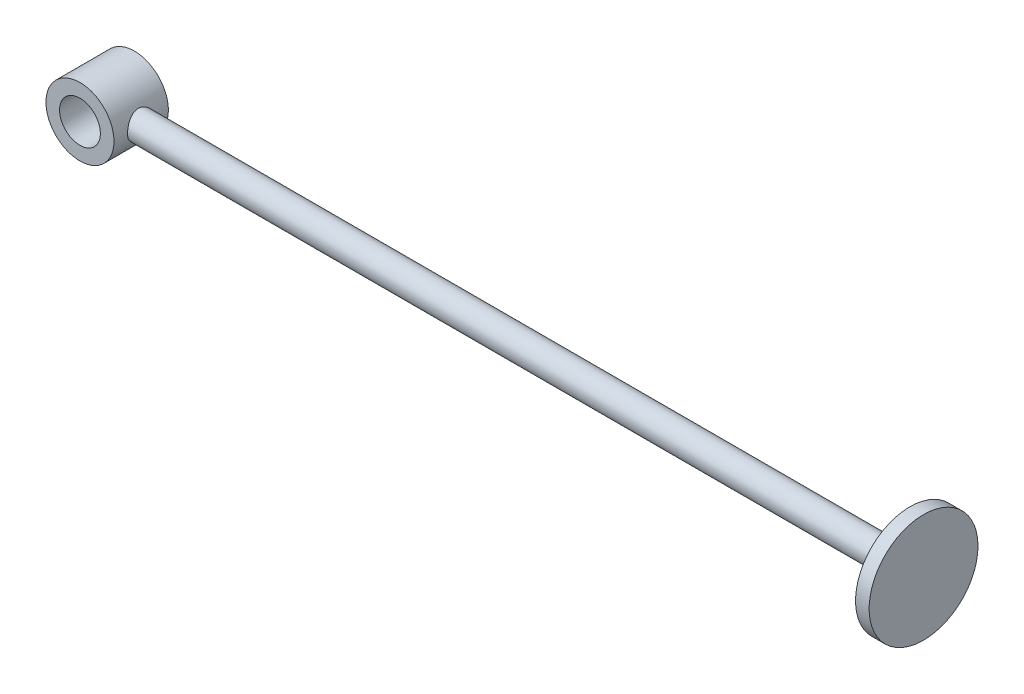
ISO-10303-21;
HEADER;
FILE_DESCRIPTION(('STEP AP214'),'2;1');
FILE_NAME('part.step','',(''),(''),'','','');
FILE_SCHEMA(('AUTOMOTIVE_DESIGN { 1 0 10303 214 1 1 1 1 }'));
ENDSEC;
DATA;
#1=APPLICATION_CONTEXT('core data for automotive mechanical design processes');
#2=APPLICATION_PROTOCOL_DEFINITION('international standard','automotive_design',2000,#1);
#3=PRODUCT_CONTEXT('',#1,'mechanical');
#4=PRODUCT('Part','Part','',(#3));
#5=PRODUCT_RELATED_PRODUCT_CATEGORY('part','',(#4));
#6=PRODUCT_DEFINITION_FORMATION('','',#4);
#7=PRODUCT_DEFINITION_CONTEXT('part definition',#1,'design');
#8=PRODUCT_DEFINITION('design','',#6,#7);
#9=PRODUCT_DEFINITION_SHAPE('','',#8);
#10=(LENGTH_UNIT() NAMED_UNIT(*) SI_UNIT(.MILLI.,.METRE.));
#11=(NAMED_UNIT(*) PLANE_ANGLE_UNIT() SI_UNIT($,.RADIAN.));
#12=(NAMED_UNIT(*) SI_UNIT($,.STERADIAN.) SOLID_ANGLE_UNIT());
#13=UNCERTAINTY_MEASURE_WITH_UNIT(LENGTH_MEASURE(1.E-05),#10,'distance_accuracy_value','');
#14=(GEOMETRIC_REPRESENTATION_CONTEXT(3) GLOBAL_UNCERTAINTY_ASSIGNED_CONTEXT((#13)) GLOBAL_UNIT_ASSIGNED_CONTEXT((#10,
#11,#12)) REPRESENTATION_CONTEXT('',''));
#15=CARTESIAN_POINT('',(0.,0.,0.));
#16=DIRECTION('',(0.,0.,1.));
#17=DIRECTION('',(1.,0.,0.));
#18=AXIS2_PLACEMENT_3D('',#15,#16,#17);
#19=CARTESIAN_POINT('',(300.000000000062,-1.32782673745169E-10,8.5265128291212E-11));
#20=DIRECTION('',(1.00000000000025,0.,0.));
#21=DIRECTION('',(0.,0.,-0.99999999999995));
#22=AXIS2_PLACEMENT_3D('',#19,#20,#21);
#23=CYLINDRICAL_SURFACE('',#22,5.);
#24=CARTESIAN_POINT('',(295.000000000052,3.06421554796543E-11,1.02140518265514E-11));
#25=DIRECTION('',(1.00000000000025,0.,0.));
#26=DIRECTION('',(0.,0.,-0.99999999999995));
#27=AXIS2_PLACEMENT_3D('',#24,#25,#26);
#28=CIRCLE('',#27,5.);
#29=CARTESIAN_POINT('',(295.000000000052,3.06411840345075E-11,-4.99999999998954));
#30=VERTEX_POINT('',#29);
#31=EDGE_CURVE('E25',#30,#30,#28,.T.);
#32=ORIENTED_EDGE('',*,*,#31,.F.);
#33=EDGE_LOOP('',(#32));
#34=FACE_BOUND('',#33,.T.);
#35=CARTESIAN_POINT('',(12.4999999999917,-6.08402217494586E-11,-5.00000000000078));
#36=CARTESIAN_POINT('',(12.4999993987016,0.134428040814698,-4.99999922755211));
#37=CARTESIAN_POINT('',(12.4978254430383,0.268907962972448,-4.9945712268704));
#38=CARTESIAN_POINT('',(12.4891841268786,0.536916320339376,-4.97290825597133));
#39=CARTESIAN_POINT('',(12.4827138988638,0.670444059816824,-4.95666606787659));
#40=CARTESIAN_POINT('',(12.4656328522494,0.93579206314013,-4.91349125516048));
#41=CARTESIAN_POINT('',(12.4550131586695,1.06760803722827,-4.88653571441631));
#42=CARTESIAN_POINT('',(12.4299104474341,1.32834211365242,-4.82219349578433));
#43=CARTESIAN_POINT('',(12.4154258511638,1.45725900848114,-4.78480255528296));
#44=CARTESIAN_POINT('',(12.3830283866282,1.71081101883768,-4.70009768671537));
#45=CARTESIAN_POINT('',(12.3651284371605,1.83546024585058,-4.65282108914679));
#46=CARTESIAN_POINT('',(12.3263173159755,2.08021423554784,-4.54867299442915));
#47=CARTESIAN_POINT('',(12.3054050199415,2.20031728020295,-4.49179791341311));
#48=CARTESIAN_POINT('',(12.2389309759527,2.55253650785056,-4.30750693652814));
#49=CARTESIAN_POINT('',(12.1895849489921,2.77691477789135,-4.16630678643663));
#50=CARTESIAN_POINT('',(12.0832695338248,3.20878788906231,-3.84440507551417));
#51=CARTESIAN_POINT('',(12.0260638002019,3.41514420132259,-3.66226779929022));
#52=CARTESIAN_POINT('',(11.9115080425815,3.79544899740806,-3.26646553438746));
#53=CARTESIAN_POINT('',(11.8541579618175,3.96938162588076,-3.05278521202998));
#54=CARTESIAN_POINT('',(11.7714356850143,4.20603567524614,-2.70739394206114));
#55=CARTESIAN_POINT('',(11.7438622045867,4.28222203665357,-2.58522008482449));
#56=CARTESIAN_POINT('',(11.6912035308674,4.42396507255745,-2.3343638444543));
#57=CARTESIAN_POINT('',(11.6661173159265,4.48952611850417,-2.20568416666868));
#58=CARTESIAN_POINT('',(11.6192528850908,4.60945924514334,-1.9426245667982));
#59=CARTESIAN_POINT('',(11.5974748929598,4.66383056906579,-1.80824425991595));
#60=CARTESIAN_POINT('',(11.5579971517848,4.76082403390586,-1.53479113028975));
#61=CARTESIAN_POINT('',(11.5402953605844,4.80345206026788,-1.39572069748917));
#62=CARTESIAN_POINT('',(11.5103008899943,4.87487504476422,-1.12023380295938));
#63=CARTESIAN_POINT('',(11.4978009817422,4.90420529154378,-0.983978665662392));
#64=CARTESIAN_POINT('',(11.4775526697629,4.95140857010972,-0.709206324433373));
#65=CARTESIAN_POINT('',(11.4698021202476,4.96928677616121,-0.570690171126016));
#66=CARTESIAN_POINT('',(11.459329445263,4.99338985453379,-0.292486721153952));
#67=CARTESIAN_POINT('',(11.4566062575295,4.99961718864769,-0.152799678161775));
#68=CARTESIAN_POINT('',(11.4562871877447,5.00034850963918,0.126607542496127));
#69=CARTESIAN_POINT('',(11.4586910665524,4.99485304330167,0.266327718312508));
#70=CARTESIAN_POINT('',(11.4681900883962,4.97300139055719,0.534904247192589));
#71=CARTESIAN_POINT('',(11.4749456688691,4.95743098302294,0.663837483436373));
#72=CARTESIAN_POINT('',(11.4925992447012,4.9163666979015,0.919866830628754));
#73=CARTESIAN_POINT('',(11.5034986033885,4.89086955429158,1.04696232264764));
#74=CARTESIAN_POINT('',(11.5291029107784,4.83020381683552,1.29840172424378));
#75=CARTESIAN_POINT('',(11.5438069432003,4.79503755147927,1.42274628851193));
#76=CARTESIAN_POINT('',(11.5765839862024,4.71535272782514,1.66796184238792));
#77=CARTESIAN_POINT('',(11.5946582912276,4.67083057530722,1.78883147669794));
#78=CARTESIAN_POINT('',(11.6539749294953,4.52178156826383,2.14989977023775));
#79=CARTESIAN_POINT('',(11.6997808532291,4.40296429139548,2.38363297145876));
#80=CARTESIAN_POINT('',(11.7984565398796,4.1312515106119,2.82857968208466));
#81=CARTESIAN_POINT('',(11.8513289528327,3.9783432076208,3.03978468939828));
#82=CARTESIAN_POINT('',(11.9631659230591,3.62889137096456,3.45100744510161));
#83=CARTESIAN_POINT('',(12.0222854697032,3.42988845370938,3.64889829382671));
#84=CARTESIAN_POINT('',(12.1365017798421,3.00074126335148,4.00923472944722));
#85=CARTESIAN_POINT('',(12.1915977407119,2.77059080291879,4.17167325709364));
#86=CARTESIAN_POINT('',(12.2673153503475,2.4039718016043,4.38652495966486));
#87=CARTESIAN_POINT('',(12.2916102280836,2.27679500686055,4.45387262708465));
#88=CARTESIAN_POINT('',(12.3369572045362,2.01664956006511,4.57753555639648));
#89=CARTESIAN_POINT('',(12.3580106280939,1.88368330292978,4.63385532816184));
#90=CARTESIAN_POINT('',(12.3962575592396,1.6129159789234,4.73491158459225));
#91=CARTESIAN_POINT('',(12.4134518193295,1.47511586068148,4.77965032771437));
#92=CARTESIAN_POINT('',(12.4434728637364,1.19570710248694,4.85708691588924));
#93=CARTESIAN_POINT('',(12.4562999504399,1.05409872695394,4.88978559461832));
#94=CARTESIAN_POINT('',(12.4765727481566,0.776729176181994,4.94119316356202));
#95=CARTESIAN_POINT('',(12.4842928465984,0.641120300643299,4.96061765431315));
#96=CARTESIAN_POINT('',(12.4953107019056,0.368536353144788,4.98828145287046));
#97=CARTESIAN_POINT('',(12.4986069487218,0.231560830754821,4.99651694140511));
#98=CARTESIAN_POINT('',(12.5006785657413,-0.0425534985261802,5.00169671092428));
#99=CARTESIAN_POINT('',(12.4994566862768,-0.179692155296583,4.99864786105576));
#100=CARTESIAN_POINT('',(12.4925311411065,-0.45319364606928,4.98130482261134));
#101=CARTESIAN_POINT('',(12.4868258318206,-0.58955617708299,4.96700651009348));
#102=CARTESIAN_POINT('',(12.4714486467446,-0.854248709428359,4.92821788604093));
#103=CARTESIAN_POINT('',(12.461968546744,-0.982662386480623,4.90421959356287));
#104=CARTESIAN_POINT('',(12.4393027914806,-1.23695148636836,4.84633496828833));
#105=CARTESIAN_POINT('',(12.4261158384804,-1.3628260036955,4.81244517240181));
#106=CARTESIAN_POINT('',(12.3963630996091,-1.61115102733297,4.73509171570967));
#107=CARTESIAN_POINT('',(12.3797982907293,-1.73360251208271,4.69163082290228));
#108=CARTESIAN_POINT('',(12.3436873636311,-1.97439656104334,4.59549698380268));
#109=CARTESIAN_POINT('',(12.3241401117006,-2.0927375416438,4.54282053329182));
#110=CARTESIAN_POINT('',(12.2604306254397,-2.44755555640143,4.36809274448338));
#111=CARTESIAN_POINT('',(12.2121249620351,-2.67640599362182,4.23165397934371));
#112=CARTESIAN_POINT('',(12.1093295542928,-3.10864805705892,3.92513152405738));
#113=CARTESIAN_POINT('',(12.0548373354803,-3.31202942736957,3.7550343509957));
#114=CARTESIAN_POINT('',(11.9411305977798,-3.70179180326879,3.37284153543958));
#115=CARTESIAN_POINT('',(11.8818418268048,-3.88616393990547,3.1587145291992));
#116=CARTESIAN_POINT('',(11.7685360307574,-4.21689889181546,2.70135140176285));
#117=CARTESIAN_POINT('',(11.7145198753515,-4.36325544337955,2.45811049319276));
#118=CARTESIAN_POINT('',(11.6421255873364,-4.55142555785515,2.07488132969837));
#119=CARTESIAN_POINT('',(11.6193337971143,-4.60914530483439,1.94332027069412));
#120=CARTESIAN_POINT('',(11.5775147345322,-4.71320516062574,1.67521283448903));
#121=CARTESIAN_POINT('',(11.5584858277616,-4.75955021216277,1.53866865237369));
#122=CARTESIAN_POINT('',(11.5248785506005,-4.84036067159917,1.26163687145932));
#123=CARTESIAN_POINT('',(11.5102984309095,-4.87483074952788,1.12115084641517));
#124=CARTESIAN_POINT('',(11.4861263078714,-4.93151664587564,0.837305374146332));
#125=CARTESIAN_POINT('',(11.4765338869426,-4.9537334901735,0.693946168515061));
#126=CARTESIAN_POINT('',(11.4632105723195,-4.98448195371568,0.416001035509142));
#127=CARTESIAN_POINT('',(11.4591065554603,-4.99388565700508,0.281528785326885));
#128=CARTESIAN_POINT('',(11.4556539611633,-5.0018009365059,0.0121539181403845));
#129=CARTESIAN_POINT('',(11.4563069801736,-5.0003088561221,-0.122748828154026));
#130=CARTESIAN_POINT('',(11.4623486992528,-4.98644346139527,-0.391817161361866));
#131=CARTESIAN_POINT('',(11.4677350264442,-4.97407559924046,-0.525983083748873));
#132=CARTESIAN_POINT('',(11.4830569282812,-4.93860056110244,-0.792672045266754));
#133=CARTESIAN_POINT('',(11.4929942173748,-4.91548933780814,-0.925194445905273));
#134=CARTESIAN_POINT('',(11.5166044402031,-4.85990688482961,-1.1823296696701));
#135=CARTESIAN_POINT('',(11.530111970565,-4.82784722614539,-1.30704679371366));
#136=CARTESIAN_POINT('',(11.5606089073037,-4.75435551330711,-1.55326624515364));
#137=CARTESIAN_POINT('',(11.5775995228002,-4.71292020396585,-1.67476743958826));
#138=CARTESIAN_POINT('',(11.6330901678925,-4.575050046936,-2.03331443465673));
#139=CARTESIAN_POINT('',(11.6761269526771,-4.46501084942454,-2.26458726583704));
#140=CARTESIAN_POINT('',(11.7724663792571,-4.20467910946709,-2.71905640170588));
#141=CARTESIAN_POINT('',(11.8262157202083,-4.05244254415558,-2.94103209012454));
#142=CARTESIAN_POINT('',(11.9366014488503,-3.71470108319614,-3.35749788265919));
#143=CARTESIAN_POINT('',(11.9932387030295,-3.52918616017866,-3.55197967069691));
#144=CARTESIAN_POINT('',(12.0779292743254,-3.22271513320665,-3.82551348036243));
#145=CARTESIAN_POINT('',(12.1069791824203,-3.11206947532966,-3.91605646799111));
#146=CARTESIAN_POINT('',(12.1635153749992,-2.88318647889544,-4.08749937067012));
#147=CARTESIAN_POINT('',(12.1910022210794,-2.76495189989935,-4.16840276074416));
#148=CARTESIAN_POINT('',(12.2436771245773,-2.52148785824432,-4.320033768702));
#149=CARTESIAN_POINT('',(12.268863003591,-2.39625194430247,-4.39075177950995));
#150=CARTESIAN_POINT('',(12.316188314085,-2.13974317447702,-4.52130456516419));
#151=CARTESIAN_POINT('',(12.3383291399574,-2.00847311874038,-4.58114432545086));
#152=CARTESIAN_POINT('',(12.3785692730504,-1.74318503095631,-4.68843322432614));
#153=CARTESIAN_POINT('',(12.3967345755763,-1.60925996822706,-4.73608733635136));
#154=CARTESIAN_POINT('',(12.4289968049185,-1.33744351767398,-4.8199023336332));
#155=CARTESIAN_POINT('',(12.4430956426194,-1.19955402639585,-4.85606861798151));
#156=CARTESIAN_POINT('',(12.4667917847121,-0.921178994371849,-4.91646900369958));
#157=CARTESIAN_POINT('',(12.4764003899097,-0.780700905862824,-4.94073306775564));
#158=CARTESIAN_POINT('',(12.4908758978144,-0.498015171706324,-4.97717423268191));
#159=CARTESIAN_POINT('',(12.4957463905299,-0.355808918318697,-4.98936048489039));
#160=CARTESIAN_POINT('',(12.498785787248,-0.17782535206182,-4.99696366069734));
#161=CARTESIAN_POINT('',(12.4992409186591,-0.142272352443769,-4.99810203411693));
#162=CARTESIAN_POINT('',(12.4998481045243,-0.0711474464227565,-4.99962030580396));
#163=CARTESIAN_POINT('',(12.5000001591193,-0.0355755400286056,-5.00000020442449));
#164=CARTESIAN_POINT('',(12.4999999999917,-6.08402217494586E-11,-5.00000000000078));
#165=B_SPLINE_CURVE_WITH_KNOTS('',3,(#35,#36,#37,#38,#39,#40,#41,#42,#43,#44,#45,#46,#47,#48,
#49,#50,#51,#52,#53,#54,#55,#56,#57,#58,#59,#60,#61,#62,#63,#64,#65,#66,#67,#68,#69,#70,#71,#72,
#73,#74,#75,#76,#77,#78,#79,#80,#81,#82,#83,#84,#85,#86,#87,#88,#89,#90,#91,#92,#93,#94,#95,#96,
#97,#98,#99,#100,#101,#102,#103,#104,#105,#106,#107,#108,#109,#110,#111,#112,#113,#114,#115,
#116,#117,#118,#119,#120,#121,#122,#123,#124,#125,#126,#127,#128,#129,#130,#131,#132,#133,#134,
#135,#136,#137,#138,#139,#140,#141,#142,#143,#144,#145,#146,#147,#148,#149,#150,#151,#152,#153,
#154,#155,#156,#157,#158,#159,#160,#161,#162,#163,#164),.UNSPECIFIED.,.T.,.F.,(4,2,2,2,2,2,2,2,
2,2,2,2,2,2,2,2,2,2,2,2,2,2,2,2,2,2,2,2,2,2,2,2,2,2,2,2,2,2,2,2,2,2,2,2,2,2,2,2,2,2,2,2,2,2,2,2,
2,2,2,2,2,2,2,2,4),(0.,0.403247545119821,0.806764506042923,1.21114928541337,1.61569948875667,
2.01874874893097,2.42194883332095,3.22723902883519,4.06710473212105,4.90738006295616,
5.34671991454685,5.78587855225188,6.22506688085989,6.66403469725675,7.08328748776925,
7.50235071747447,7.9213253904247,8.34028052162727,8.72995920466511,9.11976620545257,
9.50947941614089,9.89934261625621,10.6941760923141,11.4893084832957,12.3459066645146,
13.2026752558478,13.640038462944,14.0772224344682,14.5143210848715,14.9513894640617,
15.3624968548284,15.7737445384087,16.1847419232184,16.5958900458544,16.9883780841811,
17.3810037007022,17.7735159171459,18.1661777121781,18.974714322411,19.7835754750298,
20.645838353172,21.5082432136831,21.9441519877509,22.3798710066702,22.8154184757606,
23.2509294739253,23.6550039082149,24.0592139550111,24.4632214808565,24.8673813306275,
25.2553678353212,25.6434892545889,26.4191721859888,27.2392679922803,28.0596113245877,
28.4968494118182,28.9339293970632,29.3714189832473,29.8087075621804,30.2380680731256,
30.6672264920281,31.0952989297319,31.5230467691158,31.6297637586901,31.7364806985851),.UNSPECIFIED.);
#166=CARTESIAN_POINT('',(12.4999999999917,-6.08402217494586E-11,-5.00000000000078));
#167=VERTEX_POINT('',#166);
#168=EDGE_CURVE('E28',#167,#167,#165,.T.);
#169=ORIENTED_EDGE('',*,*,#168,.T.);
#170=EDGE_LOOP('',(#169));
#171=FACE_BOUND('',#170,.T.);
#172=ADVANCED_FACE('F12',(#34,#171),#23,.T.);
#173=CARTESIAN_POINT('',(300.000000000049,19.9999999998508,8.5265128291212E-11));
#174=DIRECTION('',(-1.00000000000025,0.,0.));
#175=DIRECTION('',(0.,0.,0.99999999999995));
#176=AXIS2_PLACEMENT_3D('',#173,#174,#175);
#177=PLANE('',#176);
#178=CARTESIAN_POINT('',(300.000000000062,-1.32782673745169E-10,8.5265128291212E-11));
#179=DIRECTION('',(1.00000000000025,0.,0.));
#180=DIRECTION('',(0.,0.,-0.99999999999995));
#181=AXIS2_PLACEMENT_3D('',#178,#179,#180);
#182=CIRCLE('',#181,20.);
#183=CARTESIAN_POINT('',(300.000000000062,-1.32786559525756E-10,-19.9999999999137));
#184=VERTEX_POINT('',#183);
#185=EDGE_CURVE('E8',#184,#184,#182,.T.);
#186=ORIENTED_EDGE('',*,*,#185,.T.);
#187=EDGE_LOOP('',(#186));
#188=FACE_BOUND('',#187,.T.);
#189=ADVANCED_FACE('F14',(#188),#177,.F.);
#190=CARTESIAN_POINT('',(300.000000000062,-1.32782673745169E-10,8.5265128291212E-11));
#191=DIRECTION('',(1.00000000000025,0.,0.));
#192=DIRECTION('',(0.,0.,-0.99999999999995));
#193=AXIS2_PLACEMENT_3D('',#190,#191,#192);
#194=CYLINDRICAL_SURFACE('',#193,20.);
#195=CARTESIAN_POINT('',(295.000000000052,3.06421554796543E-11,1.02140518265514E-11));
#196=DIRECTION('',(1.00000000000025,0.,0.));
#197=DIRECTION('',(0.,0.,-0.99999999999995));
#198=AXIS2_PLACEMENT_3D('',#195,#196,#197);
#199=CIRCLE('',#198,20.);
#200=CARTESIAN_POINT('',(295.000000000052,3.06382696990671E-11,-19.9999999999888));
#201=VERTEX_POINT('',#200);
#202=EDGE_CURVE('E20',#201,#201,#199,.T.);
#203=ORIENTED_EDGE('',*,*,#202,.T.);
#204=EDGE_LOOP('',(#203));
#205=FACE_BOUND('',#204,.T.);
#206=ORIENTED_EDGE('',*,*,#185,.F.);
#207=EDGE_LOOP('',(#206));
#208=FACE_BOUND('',#207,.T.);
#209=ADVANCED_FACE('F65',(#205,#208),#194,.T.);
#210=CARTESIAN_POINT('',(295.000000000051,4.99999999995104,-8.88178419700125E-13));
#211=DIRECTION('',(1.00000000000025,0.,0.));
#212=DIRECTION('',(0.,0.,-0.99999999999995));
#213=AXIS2_PLACEMENT_3D('',#210,#211,#212);
#214=PLANE('',#213);
#215=ORIENTED_EDGE('',*,*,#202,.F.);
#216=EDGE_LOOP('',(#215));
#217=FACE_BOUND('',#216,.T.);
#218=ORIENTED_EDGE('',*,*,#31,.T.);
#219=EDGE_LOOP('',(#218));
#220=FACE_BOUND('',#219,.T.);
#221=ADVANCED_FACE('F43',(#217,#220),#214,.F.);
#222=CARTESIAN_POINT('',(-4.66293670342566E-12,-7.23865412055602E-11,9.99999999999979));
#223=DIRECTION('',(0.,0.,-0.99999999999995));
#224=DIRECTION('',(-1.00000000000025,0.,0.));
#225=AXIS2_PLACEMENT_3D('',#222,#223,#224);
#226=CYLINDRICAL_SURFACE('',#225,12.5);
#227=ORIENTED_EDGE('',*,*,#168,.F.);
#228=EDGE_LOOP('',(#227));
#229=FACE_BOUND('',#228,.T.);
#230=CARTESIAN_POINT('',(-4.66293670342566E-12,-7.23865412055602E-11,9.99999999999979));
#231=DIRECTION('',(0.,0.,0.99999999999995));
#232=DIRECTION('',(1.00000000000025,0.,0.));
#233=AXIS2_PLACEMENT_3D('',#230,#231,#232);
#234=CIRCLE('',#233,12.5);
#235=CARTESIAN_POINT('',(12.4999999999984,-7.23975350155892E-11,9.99999999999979));
#236=VERTEX_POINT('',#235);
#237=EDGE_CURVE('E35',#236,#236,#234,.T.);
#238=ORIENTED_EDGE('',*,*,#237,.F.);
#239=EDGE_LOOP('',(#238));
#240=FACE_BOUND('',#239,.T.);
#241=CARTESIAN_POINT('',(-9.6034291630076E-12,-2.04281036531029E-11,-9.99999999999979));
#242=DIRECTION('',(0.,0.,0.99999999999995));
#243=DIRECTION('',(1.00000000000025,0.,0.));
#244=AXIS2_PLACEMENT_3D('',#241,#242,#243);
#245=CIRCLE('',#244,12.5);
#246=CARTESIAN_POINT('',(12.4999999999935,-2.04390974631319E-11,-9.99999999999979));
#247=VERTEX_POINT('',#246);
#248=EDGE_CURVE('E76',#247,#247,#245,.T.);
#249=ORIENTED_EDGE('',*,*,#248,.T.);
#250=EDGE_LOOP('',(#249));
#251=FACE_BOUND('',#250,.T.);
#252=ADVANCED_FACE('F38',(#229,#240,#251),#226,.T.);
#253=CARTESIAN_POINT('',(-4.66293670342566E-12,-7.23865412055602E-11,9.99999999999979));
#254=DIRECTION('',(0.,0.,0.99999999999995));
#255=DIRECTION('',(1.00000000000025,0.,0.));
#256=AXIS2_PLACEMENT_3D('',#253,#254,#255);
#257=PLANE('',#256);
#258=CARTESIAN_POINT('',(-4.66293670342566E-12,-7.23865412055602E-11,9.99999999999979));
#259=DIRECTION('',(0.,0.,0.99999999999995));
#260=DIRECTION('',(1.00000000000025,0.,0.));
#261=AXIS2_PLACEMENT_3D('',#258,#259,#260);
#262=CIRCLE('',#261,7.5);
#263=CARTESIAN_POINT('',(7.49999999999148,-1.15470870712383E-11,9.99999999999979));
#264=VERTEX_POINT('',#263);
#265=EDGE_CURVE('E81',#264,#264,#262,.T.);
#266=ORIENTED_EDGE('',*,*,#265,.F.);
#267=EDGE_LOOP('',(#266));
#268=FACE_BOUND('',#267,.T.);
#269=ORIENTED_EDGE('',*,*,#237,.T.);
#270=EDGE_LOOP('',(#269));
#271=FACE_BOUND('',#270,.T.);
#272=ADVANCED_FACE('F42',(#268,#271),#257,.T.);
#273=CARTESIAN_POINT('',(-9.6034291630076E-12,-2.04281036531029E-11,-9.99999999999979));
#274=DIRECTION('',(0.,0.,0.99999999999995));
#275=DIRECTION('',(1.00000000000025,0.,0.));
#276=AXIS2_PLACEMENT_3D('',#273,#274,#275);
#277=PLANE('',#276);
#278=CARTESIAN_POINT('',(-9.6034291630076E-12,-2.04281036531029E-11,-9.99999999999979));
#279=DIRECTION('',(0.,0.,0.99999999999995));
#280=DIRECTION('',(1.00000000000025,0.,0.));
#281=AXIS2_PLACEMENT_3D('',#278,#279,#280);
#282=CIRCLE('',#281,7.5);
#283=CARTESIAN_POINT('',(7.49999999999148,-1.15509728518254E-11,-9.99999999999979));
#284=VERTEX_POINT('',#283);
#285=EDGE_CURVE('E16',#284,#284,#282,.T.);
#286=ORIENTED_EDGE('',*,*,#285,.T.);
#287=EDGE_LOOP('',(#286));
#288=FACE_BOUND('',#287,.T.);
#289=ORIENTED_EDGE('',*,*,#248,.F.);
#290=EDGE_LOOP('',(#289));
#291=FACE_BOUND('',#290,.T.);
#292=ADVANCED_FACE('F45',(#288,#291),#277,.F.);
#293=CARTESIAN_POINT('',(-1.03805852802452E-11,-1.15463194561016E-11,-20.));
#294=DIRECTION('',(0.,0.,0.99999999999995));
#295=DIRECTION('',(1.00000000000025,0.,0.));
#296=AXIS2_PLACEMENT_3D('',#293,#294,#295);
#297=CYLINDRICAL_SURFACE('',#296,7.5);
#298=CARTESIAN_POINT('',(7.49999999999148,-1.15470870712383E-11,9.99999999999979));
#299=CARTESIAN_POINT('',(7.49999999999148,-1.15471275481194E-11,9.79166666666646));
#300=CARTESIAN_POINT('',(7.49999999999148,-1.15471680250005E-11,9.58333333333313));
#301=CARTESIAN_POINT('',(7.49999999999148,-1.15472489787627E-11,9.16666666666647));
#302=CARTESIAN_POINT('',(7.49999999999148,-1.15472894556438E-11,8.95833333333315));
#303=CARTESIAN_POINT('',(7.49999999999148,-1.15473704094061E-11,8.54166666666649));
#304=CARTESIAN_POINT('',(7.49999999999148,-1.15474108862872E-11,8.33333333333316));
#305=CARTESIAN_POINT('',(7.49999999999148,-1.15474918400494E-11,7.9166666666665));
#306=CARTESIAN_POINT('',(7.49999999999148,-1.15475323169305E-11,7.70833333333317));
#307=CARTESIAN_POINT('',(7.49999999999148,-1.15476132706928E-11,7.29166666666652));
#308=CARTESIAN_POINT('',(7.49999999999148,-1.15476537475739E-11,7.08333333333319));
#309=CARTESIAN_POINT('',(7.49999999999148,-1.15477347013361E-11,6.66666666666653));
#310=CARTESIAN_POINT('',(7.49999999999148,-1.15477751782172E-11,6.4583333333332));
#311=CARTESIAN_POINT('',(7.49999999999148,-1.15478561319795E-11,6.04166666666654));
#312=CARTESIAN_POINT('',(7.49999999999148,-1.15478966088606E-11,5.83333333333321));
#313=CARTESIAN_POINT('',(7.49999999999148,-1.15479775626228E-11,5.41666666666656));
#314=CARTESIAN_POINT('',(7.49999999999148,-1.15480180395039E-11,5.20833333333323));
#315=CARTESIAN_POINT('',(7.49999999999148,-1.15480989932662E-11,4.79166666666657));
#316=CARTESIAN_POINT('',(7.49999999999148,-1.15481394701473E-11,4.58333333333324));
#317=CARTESIAN_POINT('',(7.49999999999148,-1.15482204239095E-11,4.16666666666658));
#318=CARTESIAN_POINT('',(7.49999999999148,-1.15482609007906E-11,3.95833333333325));
#319=CARTESIAN_POINT('',(7.49999999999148,-1.15483418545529E-11,3.54166666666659));
#320=CARTESIAN_POINT('',(7.49999999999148,-1.1548382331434E-11,3.33333333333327));
#321=CARTESIAN_POINT('',(7.49999999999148,-1.15484632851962E-11,2.91666666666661));
#322=CARTESIAN_POINT('',(7.49999999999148,-1.15485037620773E-11,2.70833333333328));
#323=CARTESIAN_POINT('',(7.49999999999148,-1.15485847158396E-11,2.29166666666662));
#324=CARTESIAN_POINT('',(7.49999999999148,-1.15486251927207E-11,2.08333333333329));
#325=CARTESIAN_POINT('',(7.49999999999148,-1.15487061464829E-11,1.66666666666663));
#326=CARTESIAN_POINT('',(7.49999999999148,-1.1548746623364E-11,1.4583333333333));
#327=CARTESIAN_POINT('',(7.49999999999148,-1.15488275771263E-11,1.04166666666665));
#328=CARTESIAN_POINT('',(7.49999999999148,-1.15488680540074E-11,0.833333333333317));
#329=CARTESIAN_POINT('',(7.49999999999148,-1.15489490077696E-11,0.416666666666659));
#330=CARTESIAN_POINT('',(7.49999999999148,-1.15489894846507E-11,0.208333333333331));
#331=CARTESIAN_POINT('',(7.49999999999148,-1.1549070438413E-11,-0.208333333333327));
#332=CARTESIAN_POINT('',(7.49999999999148,-1.15491109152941E-11,-0.416666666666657));
#333=CARTESIAN_POINT('',(7.49999999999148,-1.15491918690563E-11,-0.833333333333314));
#334=CARTESIAN_POINT('',(7.49999999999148,-1.15492323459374E-11,-1.04166666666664));
#335=CARTESIAN_POINT('',(7.49999999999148,-1.15493132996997E-11,-1.4583333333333));
#336=CARTESIAN_POINT('',(7.49999999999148,-1.15493537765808E-11,-1.66666666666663));
#337=CARTESIAN_POINT('',(7.49999999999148,-1.1549434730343E-11,-2.08333333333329));
#338=CARTESIAN_POINT('',(7.49999999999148,-1.15494752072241E-11,-2.29166666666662));
#339=CARTESIAN_POINT('',(7.49999999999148,-1.15495561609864E-11,-2.70833333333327));
#340=CARTESIAN_POINT('',(7.49999999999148,-1.15495966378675E-11,-2.9166666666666));
#341=CARTESIAN_POINT('',(7.49999999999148,-1.15496775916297E-11,-3.33333333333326));
#342=CARTESIAN_POINT('',(7.49999999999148,-1.15497180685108E-11,-3.54166666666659));
#343=CARTESIAN_POINT('',(7.49999999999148,-1.15497990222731E-11,-3.95833333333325));
#344=CARTESIAN_POINT('',(7.49999999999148,-1.15498394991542E-11,-4.16666666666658));
#345=CARTESIAN_POINT('',(7.49999999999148,-1.15499204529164E-11,-4.58333333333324));
#346=CARTESIAN_POINT('',(7.49999999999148,-1.15499609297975E-11,-4.79166666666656));
#347=CARTESIAN_POINT('',(7.49999999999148,-1.15500418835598E-11,-5.20833333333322));
#348=CARTESIAN_POINT('',(7.49999999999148,-1.15500823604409E-11,-5.41666666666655));
#349=CARTESIAN_POINT('',(7.49999999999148,-1.15501633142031E-11,-5.83333333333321));
#350=CARTESIAN_POINT('',(7.49999999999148,-1.15502037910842E-11,-6.04166666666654));
#351=CARTESIAN_POINT('',(7.49999999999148,-1.15502847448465E-11,-6.45833333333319));
#352=CARTESIAN_POINT('',(7.49999999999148,-1.15503252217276E-11,-6.66666666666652));
#353=CARTESIAN_POINT('',(7.49999999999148,-1.15504061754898E-11,-7.08333333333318));
#354=CARTESIAN_POINT('',(7.49999999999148,-1.15504466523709E-11,-7.29166666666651));
#355=CARTESIAN_POINT('',(7.49999999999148,-1.15505276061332E-11,-7.70833333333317));
#356=CARTESIAN_POINT('',(7.49999999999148,-1.15505680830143E-11,-7.9166666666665));
#357=CARTESIAN_POINT('',(7.49999999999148,-1.15506490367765E-11,-8.33333333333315));
#358=CARTESIAN_POINT('',(7.49999999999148,-1.15506895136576E-11,-8.54166666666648));
#359=CARTESIAN_POINT('',(7.49999999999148,-1.15507704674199E-11,-8.95833333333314));
#360=CARTESIAN_POINT('',(7.49999999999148,-1.1550810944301E-11,-9.16666666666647));
#361=CARTESIAN_POINT('',(7.49999999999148,-1.15508918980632E-11,-9.58333333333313));
#362=CARTESIAN_POINT('',(7.49999999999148,-1.15509323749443E-11,-9.79166666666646));
#363=CARTESIAN_POINT('',(7.49999999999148,-1.15509728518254E-11,-9.99999999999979));
#364=B_SPLINE_CURVE_WITH_KNOTS('',3,(#298,#299,#300,#301,#302,#303,#304,#305,#306,#307,#308,
#309,#310,#311,#312,#313,#314,#315,#316,#317,#318,#319,#320,#321,#322,#323,#324,#325,#326,#327,
#328,#329,#330,#331,#332,#333,#334,#335,#336,#337,#338,#339,#340,#341,#342,#343,#344,#345,#346,
#347,#348,#349,#350,#351,#352,#353,#354,#355,#356,#357,#358,#359,#360,#361,#362,#363),
.UNSPECIFIED.,.F.,.F.,(4,2,2,2,2,2,2,2,2,2,2,2,2,2,2,2,2,2,2,2,2,2,2,2,2,2,2,2,2,2,2,2,4),(0.,
0.624999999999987,1.24999999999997,1.87499999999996,2.49999999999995,3.12499999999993,
3.74999999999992,4.37499999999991,4.99999999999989,5.62499999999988,6.24999999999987,
6.87499999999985,7.49999999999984,8.12499999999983,8.74999999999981,9.3749999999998,
9.99999999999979,10.6249999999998,11.2499999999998,11.8749999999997,12.4999999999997,
13.1249999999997,13.7499999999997,14.3749999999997,14.9999999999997,15.6249999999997,
16.2499999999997,16.8749999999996,17.4999999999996,18.1249999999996,18.7499999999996,
19.3749999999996,19.9999999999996),.UNSPECIFIED.);
#365=EDGE_CURVE('BSEAM51',#264,#284,#364,.T.);
#366=ORIENTED_EDGE('',*,*,#265,.T.);
#367=ORIENTED_EDGE('',*,*,#285,.F.);
#368=ORIENTED_EDGE('',*,*,#365,.T.);
#369=ORIENTED_EDGE('',*,*,#365,.F.);
#370=EDGE_LOOP('',(#366,#368,#367,#369));
#371=FACE_BOUND('',#370,.T.);
#372=ADVANCED_FACE('F51',(#371),#297,.F.);
#373=CLOSED_SHELL('',(#172,#189,#209,#221,#252,#272,#292,#372));
#374=MANIFOLD_SOLID_BREP('B1',#373);
#375=ADVANCED_BREP_SHAPE_REPRESENTATION('',(#18,#374),#14);
#376=SHAPE_DEFINITION_REPRESENTATION(#9,#375);
ENDSEC;
END-ISO-10303-21;
